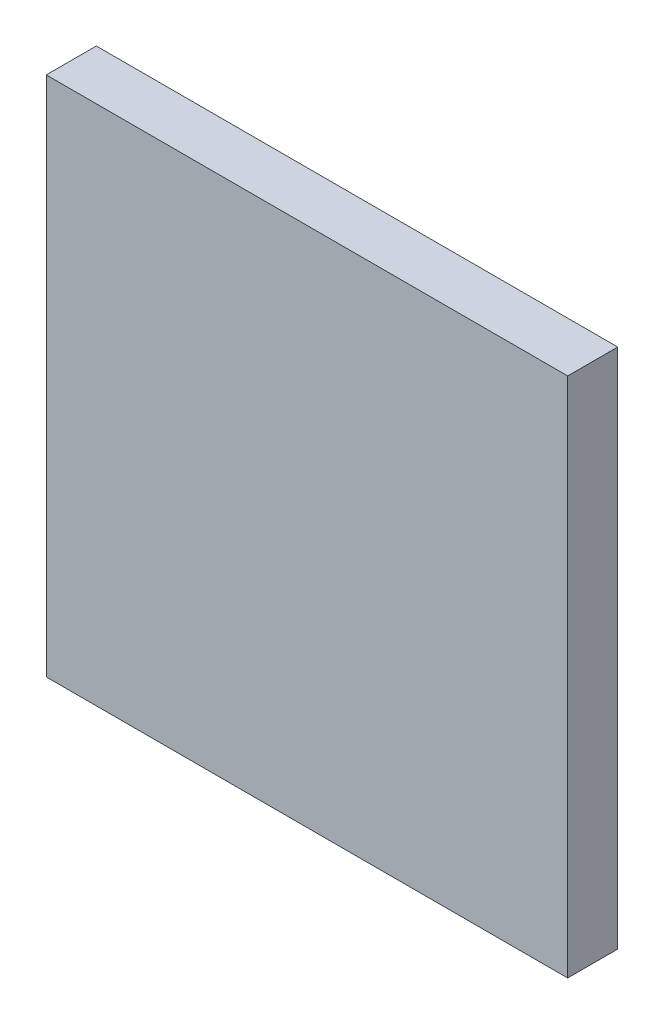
ISO-10303-21;
HEADER;
FILE_DESCRIPTION(('STEP AP214'),'2;1');
FILE_NAME('part.step','',(''),(''),'','','');
FILE_SCHEMA(('AUTOMOTIVE_DESIGN { 1 0 10303 214 1 1 1 1 }'));
ENDSEC;
DATA;
#1=APPLICATION_CONTEXT('core data for automotive mechanical design processes');
#2=APPLICATION_PROTOCOL_DEFINITION('international standard','automotive_design',2000,#1);
#3=PRODUCT_CONTEXT('',#1,'mechanical');
#4=PRODUCT('Part','Part','',(#3));
#5=PRODUCT_RELATED_PRODUCT_CATEGORY('part','',(#4));
#6=PRODUCT_DEFINITION_FORMATION('','',#4);
#7=PRODUCT_DEFINITION_CONTEXT('part definition',#1,'design');
#8=PRODUCT_DEFINITION('design','',#6,#7);
#9=PRODUCT_DEFINITION_SHAPE('','',#8);
#10=(LENGTH_UNIT() NAMED_UNIT(*) SI_UNIT(.MILLI.,.METRE.));
#11=(NAMED_UNIT(*) PLANE_ANGLE_UNIT() SI_UNIT($,.RADIAN.));
#12=(NAMED_UNIT(*) SI_UNIT($,.STERADIAN.) SOLID_ANGLE_UNIT());
#13=UNCERTAINTY_MEASURE_WITH_UNIT(LENGTH_MEASURE(1.E-05),#10,'distance_accuracy_value','');
#14=(GEOMETRIC_REPRESENTATION_CONTEXT(3) GLOBAL_UNCERTAINTY_ASSIGNED_CONTEXT((#13)) GLOBAL_UNIT_ASSIGNED_CONTEXT((#10,
#11,#12)) REPRESENTATION_CONTEXT('',''));
#15=CARTESIAN_POINT('',(0.,0.,0.));
#16=DIRECTION('',(0.,0.,1.));
#17=DIRECTION('',(1.,0.,0.));
#18=AXIS2_PLACEMENT_3D('',#15,#16,#17);
#19=CARTESIAN_POINT('',(0.,0.,-1.2192));
#20=DIRECTION('',(-1.,0.,0.));
#21=DIRECTION('',(0.,-1.,0.));
#22=AXIS2_PLACEMENT_3D('',#19,#20,#21);
#23=PLANE('',#22);
#24=DIRECTION('',(0.,-1.,0.));
#25=VECTOR('',#24,1.);
#26=CARTESIAN_POINT('',(0.,0.,0.));
#27=LINE('',#26,#25);
#28=CARTESIAN_POINT('',(0.,0.,0.));
#29=VERTEX_POINT('',#28);
#30=CARTESIAN_POINT('',(0.,-12.7,0.));
#31=VERTEX_POINT('',#30);
#32=EDGE_CURVE('E104',#29,#31,#27,.T.);
#33=ORIENTED_EDGE('',*,*,#32,.F.);
#34=DIRECTION('',(0.,0.,1.));
#35=VECTOR('',#34,1.);
#36=CARTESIAN_POINT('',(0.,0.,-1.2192));
#37=LINE('',#36,#35);
#38=CARTESIAN_POINT('',(0.,0.,-1.2192));
#39=VERTEX_POINT('',#38);
#40=EDGE_CURVE('E11',#39,#29,#37,.T.);
#41=ORIENTED_EDGE('',*,*,#40,.F.);
#42=DIRECTION('',(0.,-1.,0.));
#43=VECTOR('',#42,1.);
#44=CARTESIAN_POINT('',(0.,0.,-1.2192));
#45=LINE('',#44,#43);
#46=CARTESIAN_POINT('',(0.,-12.7,-1.2192));
#47=VERTEX_POINT('',#46);
#48=EDGE_CURVE('E98',#39,#47,#45,.T.);
#49=ORIENTED_EDGE('',*,*,#48,.T.);
#50=DIRECTION('',(0.,0.,1.));
#51=VECTOR('',#50,1.);
#52=CARTESIAN_POINT('',(0.,-12.7,-1.2192));
#53=LINE('',#52,#51);
#54=EDGE_CURVE('E43',#47,#31,#53,.T.);
#55=ORIENTED_EDGE('',*,*,#54,.T.);
#56=EDGE_LOOP('',(#33,#41,#49,#55));
#57=FACE_BOUND('',#56,.T.);
#58=ADVANCED_FACE('F40',(#57),#23,.T.);
#59=CARTESIAN_POINT('',(0.,0.,-1.2192));
#60=DIRECTION('',(0.,1.,0.));
#61=DIRECTION('',(0.,0.,1.));
#62=AXIS2_PLACEMENT_3D('',#59,#60,#61);
#63=PLANE('',#62);
#64=DIRECTION('',(-1.,0.,0.));
#65=VECTOR('',#64,1.);
#66=CARTESIAN_POINT('',(0.,0.,0.));
#67=LINE('',#66,#65);
#68=CARTESIAN_POINT('',(12.7,0.,0.));
#69=VERTEX_POINT('',#68);
#70=EDGE_CURVE('E100',#69,#29,#67,.T.);
#71=ORIENTED_EDGE('',*,*,#70,.F.);
#72=DIRECTION('',(0.,0.,1.));
#73=VECTOR('',#72,1.);
#74=CARTESIAN_POINT('',(12.7,0.,-1.2192));
#75=LINE('',#74,#73);
#76=CARTESIAN_POINT('',(12.7,0.,-1.2192));
#77=VERTEX_POINT('',#76);
#78=EDGE_CURVE('E49',#77,#69,#75,.T.);
#79=ORIENTED_EDGE('',*,*,#78,.F.);
#80=DIRECTION('',(-1.,0.,0.));
#81=VECTOR('',#80,1.);
#82=CARTESIAN_POINT('',(0.,0.,-1.2192));
#83=LINE('',#82,#81);
#84=EDGE_CURVE('E95',#77,#39,#83,.T.);
#85=ORIENTED_EDGE('',*,*,#84,.T.);
#86=ORIENTED_EDGE('',*,*,#40,.T.);
#87=EDGE_LOOP('',(#71,#79,#85,#86));
#88=FACE_BOUND('',#87,.T.);
#89=ADVANCED_FACE('F114',(#88),#63,.T.);
#90=CARTESIAN_POINT('',(12.7,0.,-1.2192));
#91=DIRECTION('',(1.,0.,0.));
#92=DIRECTION('',(0.,1.,0.));
#93=AXIS2_PLACEMENT_3D('',#90,#91,#92);
#94=PLANE('',#93);
#95=DIRECTION('',(0.,1.,0.));
#96=VECTOR('',#95,1.);
#97=CARTESIAN_POINT('',(12.7,0.,0.));
#98=LINE('',#97,#96);
#99=CARTESIAN_POINT('',(12.7,-12.7,0.));
#100=VERTEX_POINT('',#99);
#101=EDGE_CURVE('E90',#100,#69,#98,.T.);
#102=ORIENTED_EDGE('',*,*,#101,.F.);
#103=DIRECTION('',(0.,0.,1.));
#104=VECTOR('',#103,1.);
#105=CARTESIAN_POINT('',(12.7,-12.7,-1.2192));
#106=LINE('',#105,#104);
#107=CARTESIAN_POINT('',(12.7,-12.7,-1.2192));
#108=VERTEX_POINT('',#107);
#109=EDGE_CURVE('E85',#108,#100,#106,.T.);
#110=ORIENTED_EDGE('',*,*,#109,.F.);
#111=DIRECTION('',(0.,1.,0.));
#112=VECTOR('',#111,1.);
#113=CARTESIAN_POINT('',(12.7,0.,-1.2192));
#114=LINE('',#113,#112);
#115=EDGE_CURVE('E88',#108,#77,#114,.T.);
#116=ORIENTED_EDGE('',*,*,#115,.T.);
#117=ORIENTED_EDGE('',*,*,#78,.T.);
#118=EDGE_LOOP('',(#102,#110,#116,#117));
#119=FACE_BOUND('',#118,.T.);
#120=ADVANCED_FACE('F87',(#119),#94,.T.);
#121=CARTESIAN_POINT('',(0.,-12.7,-1.2192));
#122=DIRECTION('',(0.,-1.,0.));
#123=DIRECTION('',(0.,0.,-1.));
#124=AXIS2_PLACEMENT_3D('',#121,#122,#123);
#125=PLANE('',#124);
#126=DIRECTION('',(1.,0.,0.));
#127=VECTOR('',#126,1.);
#128=CARTESIAN_POINT('',(0.,-12.7,0.));
#129=LINE('',#128,#127);
#130=EDGE_CURVE('E107',#31,#100,#129,.T.);
#131=ORIENTED_EDGE('',*,*,#130,.F.);
#132=ORIENTED_EDGE('',*,*,#54,.F.);
#133=DIRECTION('',(1.,0.,0.));
#134=VECTOR('',#133,1.);
#135=CARTESIAN_POINT('',(0.,-12.7,-1.2192));
#136=LINE('',#135,#134);
#137=EDGE_CURVE('E94',#47,#108,#136,.T.);
#138=ORIENTED_EDGE('',*,*,#137,.T.);
#139=ORIENTED_EDGE('',*,*,#109,.T.);
#140=EDGE_LOOP('',(#131,#132,#138,#139));
#141=FACE_BOUND('',#140,.T.);
#142=ADVANCED_FACE('F97',(#141),#125,.T.);
#143=CARTESIAN_POINT('',(0.,0.,-1.2192));
#144=DIRECTION('',(0.,0.,1.));
#145=DIRECTION('',(1.,0.,0.));
#146=AXIS2_PLACEMENT_3D('',#143,#144,#145);
#147=PLANE('',#146);
#148=ORIENTED_EDGE('',*,*,#48,.F.);
#149=ORIENTED_EDGE('',*,*,#84,.F.);
#150=ORIENTED_EDGE('',*,*,#115,.F.);
#151=ORIENTED_EDGE('',*,*,#137,.F.);
#152=EDGE_LOOP('',(#148,#149,#150,#151));
#153=FACE_BOUND('',#152,.T.);
#154=ADVANCED_FACE('F93',(#153),#147,.F.);
#155=CARTESIAN_POINT('',(0.,0.,0.));
#156=DIRECTION('',(0.,0.,1.));
#157=DIRECTION('',(1.,0.,0.));
#158=AXIS2_PLACEMENT_3D('',#155,#156,#157);
#159=PLANE('',#158);
#160=ORIENTED_EDGE('',*,*,#32,.T.);
#161=ORIENTED_EDGE('',*,*,#130,.T.);
#162=ORIENTED_EDGE('',*,*,#101,.T.);
#163=ORIENTED_EDGE('',*,*,#70,.T.);
#164=EDGE_LOOP('',(#160,#161,#162,#163));
#165=FACE_BOUND('',#164,.T.);
#166=ADVANCED_FACE('F113',(#165),#159,.T.);
#167=CLOSED_SHELL('',(#58,#89,#120,#142,#154,#166));
#168=MANIFOLD_SOLID_BREP('B2',#167);
#169=ADVANCED_BREP_SHAPE_REPRESENTATION('',(#18,#168),#14);
#170=SHAPE_DEFINITION_REPRESENTATION(#9,#169);
ENDSEC;
END-ISO-10303-21;
